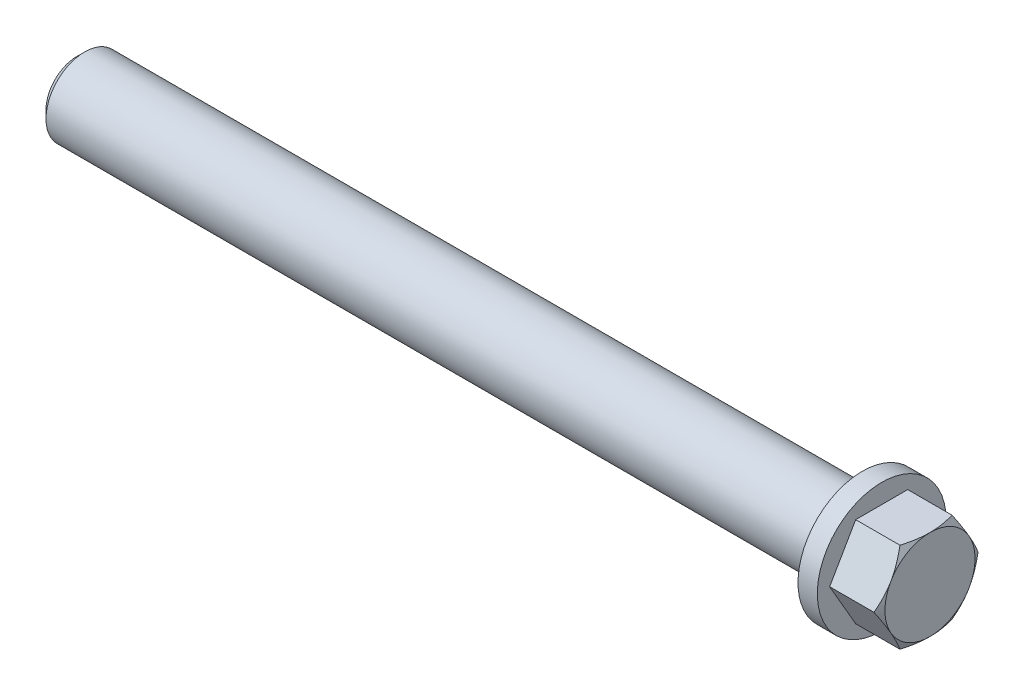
from build123d import *

# Parameters (mm, degrees)
BASE_EXTRUSION_DEPTH = 7.5
ESQUISSE2_R          = 6
BOSS_EXTRU_1_DEPTH   = 125
CHANFREIN1_SIZE      = 1.2
ESQUISSE4_W          = 3
ESQUISSE4_H          = 10
ESQUISSE5_W          = 34
ESQUISSE5_H          = 6


with BuildPart() as part:
    # Esquisse1 → Base-Extrusion (new body)
    with BuildSketch(Plane(origin=(0, 0, 0), x_dir=(0, 0, -1), z_dir=(1, 0, 0))):
        Polygon((8.082903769, 0), (4.041451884, 7), (-4.041451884, 7), (-8.082903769, 0), (-4.041451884, -7), (4.041451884, -7), align=None)
    extrude(amount=BASE_EXTRUSION_DEPTH)

    # Esquisse2 → Boss.-Extru.1 (add)
    with BuildSketch(Plane.ZY):
        Circle(ESQUISSE2_R)
    extrude(amount=BOSS_EXTRU_1_DEPTH)

    # Esquisse3 → Enl_vement de mati_re-R_volution1 (revolve, cut)
    with BuildSketch(Plane.XY):
        Polygon((7.5, -7), (0, -19.990381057), (7.5, -19.990381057), align=None)
    revolve(axis=Axis((0, 0, 0), (1, 0, 0)), mode=Mode.SUBTRACT)

    # Chanfrein1
    chanfrein1_edges = [part.edges().sort_by_distance(p)[0] for p in [
        (-125, 0, -6),
    ]]
    chamfer(chanfrein1_edges, length=CHANFREIN1_SIZE)

    # Esquisse4 → R_volution1 (revolve)
    with BuildSketch(Plane.XY, mode=Mode.PRIVATE) as r_volution1_sk:
        with Locations((-1.5, 5)):
            Rectangle(ESQUISSE4_W, ESQUISSE4_H)
    revolve(r_volution1_sk.sketch.rotate(Axis((0, 0, 0), (-1, 0, 0)), 90), axis=Axis((0, 0, 0), (-1, 0, 0)))

    # Esquisse5 → R_volution2 (revolve)
    with BuildSketch(Plane.XY):
        with Locations((-20, 3)):
            Rectangle(ESQUISSE5_W, ESQUISSE5_H)
    revolve(axis=Axis((0, 0, 0), (-1, 0, 0)))


solid = part.part
